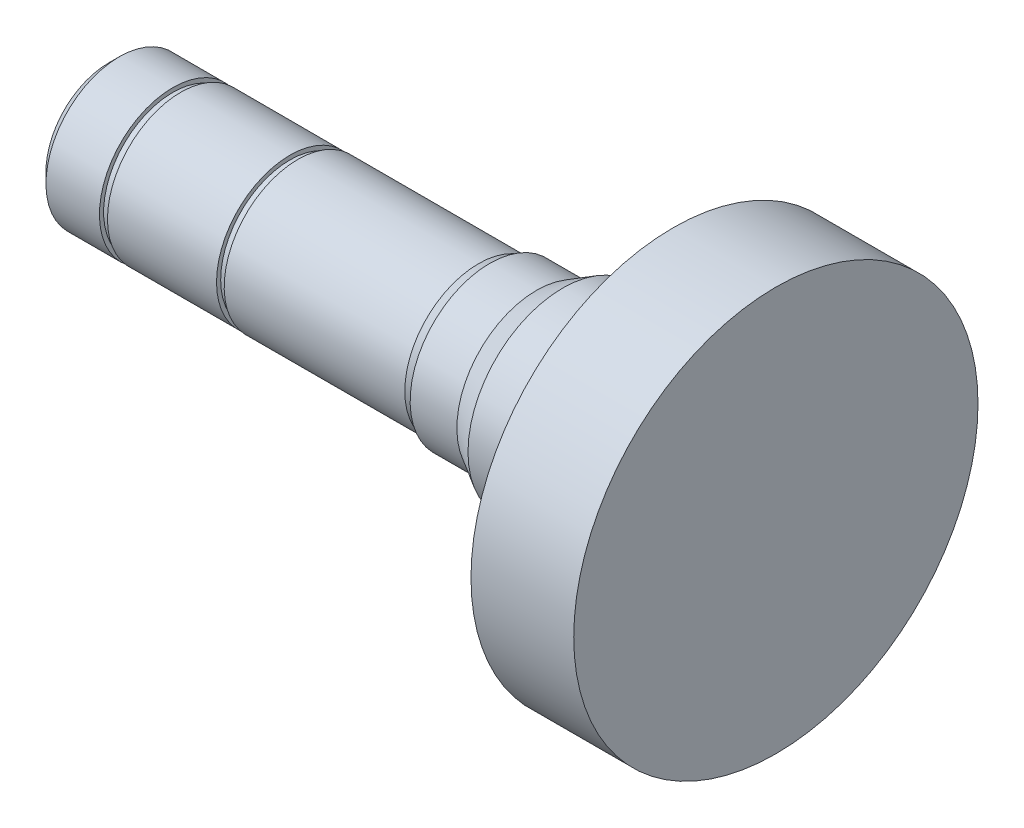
ISO-10303-21;
HEADER;
FILE_DESCRIPTION(('STEP AP214'),'2;1');
FILE_NAME('part.step','',(''),(''),'','','');
FILE_SCHEMA(('AUTOMOTIVE_DESIGN { 1 0 10303 214 1 1 1 1 }'));
ENDSEC;
DATA;
#1=APPLICATION_CONTEXT('core data for automotive mechanical design processes');
#2=APPLICATION_PROTOCOL_DEFINITION('international standard','automotive_design',2000,#1);
#3=PRODUCT_CONTEXT('',#1,'mechanical');
#4=PRODUCT('Part','Part','',(#3));
#5=PRODUCT_RELATED_PRODUCT_CATEGORY('part','',(#4));
#6=PRODUCT_DEFINITION_FORMATION('','',#4);
#7=PRODUCT_DEFINITION_CONTEXT('part definition',#1,'design');
#8=PRODUCT_DEFINITION('design','',#6,#7);
#9=PRODUCT_DEFINITION_SHAPE('','',#8);
#10=(LENGTH_UNIT() NAMED_UNIT(*) SI_UNIT(.MILLI.,.METRE.));
#11=(NAMED_UNIT(*) PLANE_ANGLE_UNIT() SI_UNIT($,.RADIAN.));
#12=(NAMED_UNIT(*) SI_UNIT($,.STERADIAN.) SOLID_ANGLE_UNIT());
#13=UNCERTAINTY_MEASURE_WITH_UNIT(LENGTH_MEASURE(1.E-05),#10,'distance_accuracy_value','');
#14=(GEOMETRIC_REPRESENTATION_CONTEXT(3) GLOBAL_UNCERTAINTY_ASSIGNED_CONTEXT((#13)) GLOBAL_UNIT_ASSIGNED_CONTEXT((#10,
#11,#12)) REPRESENTATION_CONTEXT('',''));
#15=CARTESIAN_POINT('',(0.,0.,0.));
#16=DIRECTION('',(0.,0.,1.));
#17=DIRECTION('',(1.,0.,0.));
#18=AXIS2_PLACEMENT_3D('',#15,#16,#17);
#19=CARTESIAN_POINT('',(0.,0.,0.));
#20=DIRECTION('',(1.,0.,0.));
#21=DIRECTION('',(0.,1.,0.));
#22=AXIS2_PLACEMENT_3D('',#19,#20,#21);
#23=PLANE('',#22);
#24=CARTESIAN_POINT('',(0.,0.,0.));
#25=DIRECTION('',(1.,0.,0.));
#26=DIRECTION('',(0.,1.,0.));
#27=AXIS2_PLACEMENT_3D('',#24,#25,#26);
#28=CIRCLE('',#27,14.925);
#29=CARTESIAN_POINT('',(0.,14.925,0.));
#30=VERTEX_POINT('',#29);
#31=EDGE_CURVE('E156',#30,#30,#28,.T.);
#32=ORIENTED_EDGE('',*,*,#31,.F.);
#33=EDGE_LOOP('',(#32));
#34=FACE_BOUND('',#33,.T.);
#35=CARTESIAN_POINT('',(0.,0.,0.));
#36=DIRECTION('',(1.,0.,0.));
#37=DIRECTION('',(0.,1.,0.));
#38=AXIS2_PLACEMENT_3D('',#35,#36,#37);
#39=CIRCLE('',#38,7.055);
#40=CARTESIAN_POINT('',(0.,7.05499999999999,0.));
#41=VERTEX_POINT('',#40);
#42=EDGE_CURVE('E77',#41,#41,#39,.T.);
#43=ORIENTED_EDGE('',*,*,#42,.T.);
#44=EDGE_LOOP('',(#43));
#45=FACE_BOUND('',#44,.T.);
#46=ADVANCED_FACE('F56',(#34,#45),#23,.F.);
#47=CARTESIAN_POINT('',(78.2,0.,0.));
#48=DIRECTION('',(1.,0.,0.));
#49=DIRECTION('',(0.,0.877582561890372,0.479425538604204));
#50=AXIS2_PLACEMENT_3D('',#47,#48,#49);
#51=CYLINDRICAL_SURFACE('',#50,17.425);
#52=CARTESIAN_POINT('',(2.5,0.,0.));
#53=DIRECTION('',(1.,0.,0.));
#54=DIRECTION('',(0.,1.,0.));
#55=AXIS2_PLACEMENT_3D('',#52,#53,#54);
#56=CIRCLE('',#55,17.425);
#57=CARTESIAN_POINT('',(2.5,17.425,0.));
#58=VERTEX_POINT('',#57);
#59=EDGE_CURVE('E117',#58,#58,#56,.T.);
#60=ORIENTED_EDGE('',*,*,#59,.T.);
#61=EDGE_LOOP('',(#60));
#62=FACE_BOUND('',#61,.T.);
#63=CARTESIAN_POINT('',(15.2,-1.0001519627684E-11,1.0001519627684E-11));
#64=DIRECTION('',(1.,0.,0.));
#65=DIRECTION('',(0.,0.,-1.));
#66=AXIS2_PLACEMENT_3D('',#63,#64,#65);
#67=CIRCLE('',#66,17.4249999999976);
#68=CARTESIAN_POINT('',(15.2,-1.0001519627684E-11,-17.4249999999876));
#69=VERTEX_POINT('',#68);
#70=EDGE_CURVE('E102',#69,#69,#67,.T.);
#71=ORIENTED_EDGE('',*,*,#70,.F.);
#72=EDGE_LOOP('',(#71));
#73=FACE_BOUND('',#72,.T.);
#74=ADVANCED_FACE('F780',(#62,#73),#51,.T.);
#75=CARTESIAN_POINT('',(101.551626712,0.,0.));
#76=DIRECTION('',(1.,0.,0.));
#77=DIRECTION('',(0.,0.877582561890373,0.479425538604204));
#78=AXIS2_PLACEMENT_3D('',#75,#76,#77);
#79=CONICAL_SURFACE('',#78,18.9,0.523598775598);
#80=CARTESIAN_POINT('',(101.551626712,0.,0.));
#81=DIRECTION('',(1.,0.,0.));
#82=DIRECTION('',(0.,1.,0.));
#83=AXIS2_PLACEMENT_3D('',#80,#81,#82);
#84=CIRCLE('',#83,18.9);
#85=CARTESIAN_POINT('',(101.551626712,18.9,0.));
#86=VERTEX_POINT('',#85);
#87=EDGE_CURVE('E532',#86,#86,#84,.T.);
#88=ORIENTED_EDGE('',*,*,#87,.T.);
#89=EDGE_LOOP('',(#88));
#90=FACE_BOUND('',#89,.T.);
#91=CARTESIAN_POINT('',(107.8,0.,0.));
#92=DIRECTION('',(1.,0.,0.));
#93=DIRECTION('',(0.,0.,-1.));
#94=AXIS2_PLACEMENT_3D('',#91,#92,#93);
#95=CIRCLE('',#94,22.5075);
#96=CARTESIAN_POINT('',(107.8,0.,-22.5075));
#97=VERTEX_POINT('',#96);
#98=EDGE_CURVE('E95',#97,#97,#95,.T.);
#99=ORIENTED_EDGE('',*,*,#98,.F.);
#100=EDGE_LOOP('',(#99));
#101=FACE_BOUND('',#100,.T.);
#102=ADVANCED_FACE('F4323',(#90,#101),#79,.T.);
#103=CARTESIAN_POINT('',(78.2,0.,0.));
#104=DIRECTION('',(1.,0.,0.));
#105=DIRECTION('',(0.,0.877582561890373,0.479425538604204));
#106=AXIS2_PLACEMENT_3D('',#103,#104,#105);
#107=CYLINDRICAL_SURFACE('',#106,18.9);
#108=CARTESIAN_POINT('',(90.45,0.,0.));
#109=DIRECTION('',(1.,0.,0.));
#110=DIRECTION('',(0.,1.,0.));
#111=AXIS2_PLACEMENT_3D('',#108,#109,#110);
#112=CIRCLE('',#111,18.9);
#113=CARTESIAN_POINT('',(90.45,18.9,0.));
#114=VERTEX_POINT('',#113);
#115=EDGE_CURVE('E123',#114,#114,#112,.T.);
#116=ORIENTED_EDGE('',*,*,#115,.T.);
#117=EDGE_LOOP('',(#116));
#118=FACE_BOUND('',#117,.T.);
#119=ORIENTED_EDGE('',*,*,#87,.F.);
#120=EDGE_LOOP('',(#119));
#121=FACE_BOUND('',#120,.T.);
#122=ADVANCED_FACE('F4332',(#118,#121),#107,.T.);
#123=CARTESIAN_POINT('',(90.45,17.4575,0.));
#124=DIRECTION('',(1.,0.,0.));
#125=DIRECTION('',(0.,1.,0.));
#126=AXIS2_PLACEMENT_3D('',#123,#124,#125);
#127=PLANE('',#126);
#128=ORIENTED_EDGE('',*,*,#115,.F.);
#129=EDGE_LOOP('',(#128));
#130=FACE_BOUND('',#129,.T.);
#131=CARTESIAN_POINT('',(90.45,0.,0.));
#132=DIRECTION('',(1.,0.,0.));
#133=DIRECTION('',(0.,1.,0.));
#134=AXIS2_PLACEMENT_3D('',#131,#132,#133);
#135=CIRCLE('',#134,17.4575);
#136=CARTESIAN_POINT('',(90.45,17.4575,0.));
#137=VERTEX_POINT('',#136);
#138=EDGE_CURVE('E118',#137,#137,#135,.T.);
#139=ORIENTED_EDGE('',*,*,#138,.T.);
#140=EDGE_LOOP('',(#139));
#141=FACE_BOUND('',#140,.T.);
#142=ADVANCED_FACE('F4330',(#130,#141),#127,.F.);
#143=CARTESIAN_POINT('',(89.65,0.,0.));
#144=DIRECTION('',(1.,0.,0.));
#145=DIRECTION('',(0.,0.877582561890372,0.479425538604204));
#146=AXIS2_PLACEMENT_3D('',#143,#144,#145);
#147=TOROIDAL_SURFACE('',#146,17.4575,0.8);
#148=CARTESIAN_POINT('',(89.2868076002,0.,0.));
#149=DIRECTION('',(1.,0.,0.));
#150=DIRECTION('',(0.,1.,0.));
#151=AXIS2_PLACEMENT_3D('',#148,#149,#150);
#152=CIRCLE('',#151,16.7446947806);
#153=CARTESIAN_POINT('',(89.2868076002,16.7446947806,0.));
#154=VERTEX_POINT('',#153);
#155=EDGE_CURVE('E124',#154,#154,#152,.T.);
#156=ORIENTED_EDGE('',*,*,#155,.T.);
#157=EDGE_LOOP('',(#156));
#158=FACE_BOUND('',#157,.T.);
#159=ORIENTED_EDGE('',*,*,#138,.F.);
#160=EDGE_LOOP('',(#159));
#161=FACE_BOUND('',#160,.T.);
#162=ADVANCED_FACE('F782',(#158,#161),#147,.F.);
#163=CARTESIAN_POINT('',(89.2868076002,0.,0.));
#164=DIRECTION('',(-1.,0.,0.));
#165=DIRECTION('',(0.,0.877582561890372,0.479425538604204));
#166=AXIS2_PLACEMENT_3D('',#163,#164,#165);
#167=CONICAL_SURFACE('',#166,16.7446947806,0.471238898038);
#168=CARTESIAN_POINT('',(87.7897180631,0.,0.));
#169=DIRECTION('',(1.,0.,0.));
#170=DIRECTION('',(0.,-1.,0.));
#171=AXIS2_PLACEMENT_3D('',#168,#169,#170);
#172=CIRCLE('',#171,17.5075);
#173=CARTESIAN_POINT('',(87.7897180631,-17.5075,0.));
#174=VERTEX_POINT('',#173);
#175=EDGE_CURVE('E125',#174,#174,#172,.T.);
#176=ORIENTED_EDGE('',*,*,#175,.T.);
#177=EDGE_LOOP('',(#176));
#178=FACE_BOUND('',#177,.T.);
#179=ORIENTED_EDGE('',*,*,#155,.F.);
#180=EDGE_LOOP('',(#179));
#181=FACE_BOUND('',#180,.T.);
#182=ADVANCED_FACE('F199',(#178,#181),#167,.T.);
#183=CARTESIAN_POINT('',(78.2,0.,0.));
#184=DIRECTION('',(1.,0.,0.));
#185=DIRECTION('',(0.,0.877582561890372,0.479425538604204));
#186=AXIS2_PLACEMENT_3D('',#183,#184,#185);
#187=CYLINDRICAL_SURFACE('',#186,17.5075);
#188=ORIENTED_EDGE('',*,*,#175,.F.);
#189=EDGE_LOOP('',(#188));
#190=FACE_BOUND('',#189,.T.);
#191=CARTESIAN_POINT('',(44.9,0.,0.));
#192=DIRECTION('',(1.,0.,0.));
#193=DIRECTION('',(0.,1.,0.));
#194=AXIS2_PLACEMENT_3D('',#191,#192,#193);
#195=CIRCLE('',#194,17.5075);
#196=CARTESIAN_POINT('',(44.9,17.5075,0.));
#197=VERTEX_POINT('',#196);
#198=EDGE_CURVE('E531',#197,#197,#195,.T.);
#199=ORIENTED_EDGE('',*,*,#198,.T.);
#200=EDGE_LOOP('',(#199));
#201=FACE_BOUND('',#200,.T.);
#202=ADVANCED_FACE('F188',(#190,#201),#187,.T.);
#203=CARTESIAN_POINT('',(44.9,16.44,0.));
#204=DIRECTION('',(1.,0.,0.));
#205=DIRECTION('',(0.,1.,0.));
#206=AXIS2_PLACEMENT_3D('',#203,#204,#205);
#207=PLANE('',#206);
#208=CARTESIAN_POINT('',(44.9,0.,0.));
#209=DIRECTION('',(1.,0.,0.));
#210=DIRECTION('',(0.,1.,0.));
#211=AXIS2_PLACEMENT_3D('',#208,#209,#210);
#212=CIRCLE('',#211,16.44);
#213=CARTESIAN_POINT('',(44.9,16.44,0.));
#214=VERTEX_POINT('',#213);
#215=EDGE_CURVE('E526',#214,#214,#212,.T.);
#216=ORIENTED_EDGE('',*,*,#215,.T.);
#217=EDGE_LOOP('',(#216));
#218=FACE_BOUND('',#217,.T.);
#219=ORIENTED_EDGE('',*,*,#198,.F.);
#220=EDGE_LOOP('',(#219));
#221=FACE_BOUND('',#220,.T.);
#222=ADVANCED_FACE('F198',(#218,#221),#207,.F.);
#223=CARTESIAN_POINT('',(78.2,0.,0.));
#224=DIRECTION('',(1.,0.,0.));
#225=DIRECTION('',(0.,0.877582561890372,0.479425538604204));
#226=AXIS2_PLACEMENT_3D('',#223,#224,#225);
#227=CYLINDRICAL_SURFACE('',#226,16.44);
#228=CARTESIAN_POINT('',(43.,1.00015962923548E-11,1.00015962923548E-11));
#229=DIRECTION('',(-1.,0.,0.));
#230=DIRECTION('',(0.,0.,1.));
#231=AXIS2_PLACEMENT_3D('',#228,#229,#230);
#232=CIRCLE('',#231,16.4399999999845);
#233=CARTESIAN_POINT('',(43.,1.00015962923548E-11,16.4399999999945));
#234=VERTEX_POINT('',#233);
#235=EDGE_CURVE('E114',#234,#234,#232,.T.);
#236=ORIENTED_EDGE('',*,*,#235,.F.);
#237=EDGE_LOOP('',(#236));
#238=FACE_BOUND('',#237,.T.);
#239=ORIENTED_EDGE('',*,*,#215,.F.);
#240=EDGE_LOOP('',(#239));
#241=FACE_BOUND('',#240,.T.);
#242=ADVANCED_FACE('F201',(#238,#241),#227,.T.);
#243=CARTESIAN_POINT('',(0.,0.,0.));
#244=DIRECTION('',(1.,0.,0.));
#245=DIRECTION('',(0.,0.877582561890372,0.479425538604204));
#246=AXIS2_PLACEMENT_3D('',#243,#244,#245);
#247=CONICAL_SURFACE('',#246,14.925,0.785398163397);
#248=ORIENTED_EDGE('',*,*,#31,.T.);
#249=EDGE_LOOP('',(#248));
#250=FACE_BOUND('',#249,.T.);
#251=ORIENTED_EDGE('',*,*,#59,.F.);
#252=EDGE_LOOP('',(#251));
#253=FACE_BOUND('',#252,.T.);
#254=ADVANCED_FACE('F768',(#250,#253),#247,.T.);
#255=CARTESIAN_POINT('',(43.,0.,0.));
#256=DIRECTION('',(1.,0.,0.));
#257=DIRECTION('',(0.,0.,-1.));
#258=AXIS2_PLACEMENT_3D('',#255,#256,#257);
#259=CIRCLE('',#258,17.425);
#260=CARTESIAN_POINT('',(43.,0.,-17.425));
#261=VERTEX_POINT('',#260);
#262=EDGE_CURVE('E109',#261,#261,#259,.T.);
#263=ORIENTED_EDGE('',*,*,#262,.F.);
#264=EDGE_LOOP('',(#263));
#265=FACE_BOUND('',#264,.T.);
#266=CARTESIAN_POINT('',(17.1,0.,0.));
#267=DIRECTION('',(-1.,0.,0.));
#268=DIRECTION('',(0.,0.,1.));
#269=AXIS2_PLACEMENT_3D('',#266,#267,#268);
#270=CIRCLE('',#269,17.425);
#271=CARTESIAN_POINT('',(17.1,0.,17.425));
#272=VERTEX_POINT('',#271);
#273=EDGE_CURVE('E99',#272,#272,#270,.T.);
#274=ORIENTED_EDGE('',*,*,#273,.F.);
#275=EDGE_LOOP('',(#274));
#276=FACE_BOUND('',#275,.T.);
#277=ADVANCED_FACE('F778',(#265,#276),#51,.T.);
#278=CARTESIAN_POINT('',(43.,1.00015962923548E-11,1.00015962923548E-11));
#279=DIRECTION('',(1.,0.,0.));
#280=DIRECTION('',(0.,0.,-1.));
#281=AXIS2_PLACEMENT_3D('',#278,#279,#280);
#282=PLANE('',#281);
#283=ORIENTED_EDGE('',*,*,#262,.T.);
#284=EDGE_LOOP('',(#283));
#285=FACE_BOUND('',#284,.T.);
#286=ORIENTED_EDGE('',*,*,#235,.T.);
#287=EDGE_LOOP('',(#286));
#288=FACE_BOUND('',#287,.T.);
#289=ADVANCED_FACE('F4350',(#285,#288),#282,.T.);
#290=CARTESIAN_POINT('',(17.1,0.,0.));
#291=DIRECTION('',(-1.,0.,0.));
#292=DIRECTION('',(0.,0.,1.));
#293=AXIS2_PLACEMENT_3D('',#290,#291,#292);
#294=CYLINDRICAL_SURFACE('',#293,16.4399999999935);
#295=CARTESIAN_POINT('',(15.2,0.,0.));
#296=DIRECTION('',(1.,0.,0.));
#297=DIRECTION('',(0.,0.,-1.));
#298=AXIS2_PLACEMENT_3D('',#295,#296,#297);
#299=CIRCLE('',#298,16.4399999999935);
#300=CARTESIAN_POINT('',(15.2,0.,-16.4399999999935));
#301=VERTEX_POINT('',#300);
#302=EDGE_CURVE('E105',#301,#301,#299,.T.);
#303=ORIENTED_EDGE('',*,*,#302,.T.);
#304=EDGE_LOOP('',(#303));
#305=FACE_BOUND('',#304,.T.);
#306=CARTESIAN_POINT('',(17.1,0.,0.));
#307=DIRECTION('',(1.,0.,0.));
#308=DIRECTION('',(0.,0.,-1.));
#309=AXIS2_PLACEMENT_3D('',#306,#307,#308);
#310=CIRCLE('',#309,16.4399999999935);
#311=CARTESIAN_POINT('',(17.1,0.,-16.4399999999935));
#312=VERTEX_POINT('',#311);
#313=EDGE_CURVE('E106',#312,#312,#310,.T.);
#314=ORIENTED_EDGE('',*,*,#313,.F.);
#315=EDGE_LOOP('',(#314));
#316=FACE_BOUND('',#315,.T.);
#317=ADVANCED_FACE('F4353',(#305,#316),#294,.T.);
#318=CARTESIAN_POINT('',(17.1,0.,0.));
#319=DIRECTION('',(1.,0.,0.));
#320=DIRECTION('',(0.,0.,-1.));
#321=AXIS2_PLACEMENT_3D('',#318,#319,#320);
#322=PLANE('',#321);
#323=ORIENTED_EDGE('',*,*,#313,.T.);
#324=EDGE_LOOP('',(#323));
#325=FACE_BOUND('',#324,.T.);
#326=ORIENTED_EDGE('',*,*,#273,.T.);
#327=EDGE_LOOP('',(#326));
#328=FACE_BOUND('',#327,.T.);
#329=ADVANCED_FACE('F4357',(#325,#328),#322,.F.);
#330=CARTESIAN_POINT('',(15.2,0.,0.));
#331=DIRECTION('',(1.,0.,0.));
#332=DIRECTION('',(0.,0.,-1.));
#333=AXIS2_PLACEMENT_3D('',#330,#331,#332);
#334=PLANE('',#333);
#335=ORIENTED_EDGE('',*,*,#302,.F.);
#336=EDGE_LOOP('',(#335));
#337=FACE_BOUND('',#336,.T.);
#338=ORIENTED_EDGE('',*,*,#70,.T.);
#339=EDGE_LOOP('',(#338));
#340=FACE_BOUND('',#339,.T.);
#341=ADVANCED_FACE('F4359',(#337,#340),#334,.T.);
#342=CARTESIAN_POINT('',(133.8,0.,0.));
#343=DIRECTION('',(-1.,0.,0.));
#344=DIRECTION('',(0.,0.,1.));
#345=AXIS2_PLACEMENT_3D('',#342,#343,#344);
#346=CYLINDRICAL_SURFACE('',#345,22.5075);
#347=CARTESIAN_POINT('',(132.6,0.,0.));
#348=DIRECTION('',(1.,0.,0.));
#349=DIRECTION('',(0.,0.,-1.));
#350=AXIS2_PLACEMENT_3D('',#347,#348,#349);
#351=CIRCLE('',#350,22.5075);
#352=CARTESIAN_POINT('',(132.6,0.,-22.5075));
#353=VERTEX_POINT('',#352);
#354=EDGE_CURVE('E13',#353,#353,#351,.F.);
#355=ORIENTED_EDGE('',*,*,#354,.T.);
#356=EDGE_LOOP('',(#355));
#357=FACE_BOUND('',#356,.T.);
#358=ORIENTED_EDGE('',*,*,#98,.T.);
#359=EDGE_LOOP('',(#358));
#360=FACE_BOUND('',#359,.T.);
#361=ADVANCED_FACE('F4362',(#357,#360),#346,.T.);
#362=CARTESIAN_POINT('',(134.,0.,0.));
#363=DIRECTION('',(-1.,0.,0.));
#364=DIRECTION('',(0.,0.,1.));
#365=AXIS2_PLACEMENT_3D('',#362,#363,#364);
#366=CYLINDRICAL_SURFACE('',#365,32.);
#367=CARTESIAN_POINT('',(134.,0.,0.));
#368=DIRECTION('',(-1.,0.,0.));
#369=DIRECTION('',(0.,0.,-1.));
#370=AXIS2_PLACEMENT_3D('',#367,#368,#369);
#371=CIRCLE('',#370,32.);
#372=CARTESIAN_POINT('',(134.,0.,-32.));
#373=VERTEX_POINT('',#372);
#374=EDGE_CURVE('E89',#373,#373,#371,.T.);
#375=ORIENTED_EDGE('',*,*,#374,.T.);
#376=EDGE_LOOP('',(#375));
#377=FACE_BOUND('',#376,.T.);
#378=CARTESIAN_POINT('',(133.8,0.,0.));
#379=DIRECTION('',(-1.,0.,0.));
#380=DIRECTION('',(0.,0.,-1.));
#381=AXIS2_PLACEMENT_3D('',#378,#379,#380);
#382=CIRCLE('',#381,32.);
#383=CARTESIAN_POINT('',(133.8,0.,-32.));
#384=VERTEX_POINT('',#383);
#385=EDGE_CURVE('E92',#384,#384,#382,.T.);
#386=ORIENTED_EDGE('',*,*,#385,.F.);
#387=EDGE_LOOP('',(#386));
#388=FACE_BOUND('',#387,.T.);
#389=ADVANCED_FACE('F4369',(#377,#388),#366,.T.);
#390=CARTESIAN_POINT('',(133.8,0.,0.));
#391=DIRECTION('',(1.,0.,0.));
#392=DIRECTION('',(0.,0.,-1.));
#393=AXIS2_PLACEMENT_3D('',#390,#391,#392);
#394=PLANE('',#393);
#395=CARTESIAN_POINT('',(133.8,0.,0.));
#396=DIRECTION('',(1.,0.,0.));
#397=DIRECTION('',(0.,0.,-1.));
#398=AXIS2_PLACEMENT_3D('',#395,#396,#397);
#399=CIRCLE('',#398,23.7075);
#400=CARTESIAN_POINT('',(133.8,0.,-23.7075));
#401=VERTEX_POINT('',#400);
#402=EDGE_CURVE('E63',#401,#401,#399,.T.);
#403=ORIENTED_EDGE('',*,*,#402,.T.);
#404=EDGE_LOOP('',(#403));
#405=FACE_BOUND('',#404,.T.);
#406=ORIENTED_EDGE('',*,*,#385,.T.);
#407=EDGE_LOOP('',(#406));
#408=FACE_BOUND('',#407,.T.);
#409=ADVANCED_FACE('F4301',(#405,#408),#394,.F.);
#410=CARTESIAN_POINT('',(156.4,0.,0.));
#411=DIRECTION('',(-1.,0.,0.));
#412=DIRECTION('',(0.,0.,1.));
#413=AXIS2_PLACEMENT_3D('',#410,#411,#412);
#414=CYLINDRICAL_SURFACE('',#413,48.);
#415=CARTESIAN_POINT('',(134.,0.,0.));
#416=DIRECTION('',(-1.,0.,0.));
#417=DIRECTION('',(0.,0.,-1.));
#418=AXIS2_PLACEMENT_3D('',#415,#416,#417);
#419=CIRCLE('',#418,48.);
#420=CARTESIAN_POINT('',(134.,0.,-48.));
#421=VERTEX_POINT('',#420);
#422=EDGE_CURVE('E80',#421,#421,#419,.T.);
#423=ORIENTED_EDGE('',*,*,#422,.F.);
#424=EDGE_LOOP('',(#423));
#425=FACE_BOUND('',#424,.T.);
#426=CARTESIAN_POINT('',(158.4,0.,0.));
#427=DIRECTION('',(-1.,0.,0.));
#428=DIRECTION('',(0.,0.,1.));
#429=AXIS2_PLACEMENT_3D('',#426,#427,#428);
#430=CIRCLE('',#429,48.);
#431=CARTESIAN_POINT('',(158.4,0.,48.));
#432=VERTEX_POINT('',#431);
#433=EDGE_CURVE('E76',#432,#432,#430,.T.);
#434=ORIENTED_EDGE('',*,*,#433,.T.);
#435=EDGE_LOOP('',(#434));
#436=FACE_BOUND('',#435,.T.);
#437=ADVANCED_FACE('F4314',(#425,#436),#414,.T.);
#438=CARTESIAN_POINT('',(134.,0.,0.));
#439=DIRECTION('',(1.,0.,0.));
#440=DIRECTION('',(0.,0.,-1.));
#441=AXIS2_PLACEMENT_3D('',#438,#439,#440);
#442=PLANE('',#441);
#443=ORIENTED_EDGE('',*,*,#374,.F.);
#444=EDGE_LOOP('',(#443));
#445=FACE_BOUND('',#444,.T.);
#446=ORIENTED_EDGE('',*,*,#422,.T.);
#447=EDGE_LOOP('',(#446));
#448=FACE_BOUND('',#447,.T.);
#449=ADVANCED_FACE('F4306',(#445,#448),#442,.F.);
#450=CARTESIAN_POINT('',(132.6,0.,0.));
#451=DIRECTION('',(1.,0.,0.));
#452=DIRECTION('',(0.,0.,-1.));
#453=AXIS2_PLACEMENT_3D('',#450,#451,#452);
#454=TOROIDAL_SURFACE('',#453,23.7075,1.2);
#455=ORIENTED_EDGE('',*,*,#354,.F.);
#456=EDGE_LOOP('',(#455));
#457=FACE_BOUND('',#456,.T.);
#458=ORIENTED_EDGE('',*,*,#402,.F.);
#459=EDGE_LOOP('',(#458));
#460=FACE_BOUND('',#459,.T.);
#461=ADVANCED_FACE('F58',(#457,#460),#454,.F.);
#462=CARTESIAN_POINT('',(158.4,48.,0.));
#463=DIRECTION('',(-1.,0.,0.));
#464=DIRECTION('',(0.,0.,1.));
#465=AXIS2_PLACEMENT_3D('',#462,#463,#464);
#466=PLANE('',#465);
#467=ORIENTED_EDGE('',*,*,#433,.F.);
#468=EDGE_LOOP('',(#467));
#469=FACE_BOUND('',#468,.T.);
#470=ADVANCED_FACE('F4305',(#469),#466,.F.);
#471=CARTESIAN_POINT('',(0.,0.,0.));
#472=DIRECTION('',(-1.,0.,0.));
#473=DIRECTION('',(0.,-1.,0.));
#474=AXIS2_PLACEMENT_3D('',#471,#472,#473);
#475=CONICAL_SURFACE('',#474,7.055,0.523085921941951);
#476=CARTESIAN_POINT('',(3.,0.,0.));
#477=DIRECTION('',(1.,0.,0.));
#478=DIRECTION('',(0.,1.,0.));
#479=AXIS2_PLACEMENT_3D('',#476,#477,#478);
#480=CIRCLE('',#479,5.32499999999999);
#481=CARTESIAN_POINT('',(3.,5.32499999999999,0.));
#482=VERTEX_POINT('',#481);
#483=EDGE_CURVE('E83',#482,#482,#480,.T.);
#484=ORIENTED_EDGE('',*,*,#483,.T.);
#485=EDGE_LOOP('',(#484));
#486=FACE_BOUND('',#485,.T.);
#487=ORIENTED_EDGE('',*,*,#42,.F.);
#488=EDGE_LOOP('',(#487));
#489=FACE_BOUND('',#488,.T.);
#490=ADVANCED_FACE('F70',(#486,#489),#475,.F.);
#491=CARTESIAN_POINT('',(28.,0.,0.));
#492=DIRECTION('',(-1.,0.,0.));
#493=DIRECTION('',(0.,0.,1.));
#494=AXIS2_PLACEMENT_3D('',#491,#492,#493);
#495=CONICAL_SURFACE('',#494,5.32499999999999,1.02974425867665);
#496=CARTESIAN_POINT('',(31.1995827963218,0.,0.));
#497=VERTEX_POINT('',#496);
#498=VERTEX_LOOP('',#497);
#499=FACE_BOUND('',#498,.T.);
#500=CARTESIAN_POINT('',(28.,0.,0.));
#501=DIRECTION('',(-1.,0.,0.));
#502=DIRECTION('',(0.,0.,1.));
#503=AXIS2_PLACEMENT_3D('',#500,#501,#502);
#504=CIRCLE('',#503,5.32499999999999);
#505=CARTESIAN_POINT('',(28.,0.,5.32499999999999));
#506=VERTEX_POINT('',#505);
#507=EDGE_CURVE('E74',#506,#506,#504,.T.);
#508=ORIENTED_EDGE('',*,*,#507,.T.);
#509=EDGE_LOOP('',(#508));
#510=FACE_BOUND('',#509,.T.);
#511=ADVANCED_FACE('F66',(#499,#510),#495,.F.);
#512=CARTESIAN_POINT('',(0.,0.,0.));
#513=DIRECTION('',(-1.,0.,0.));
#514=DIRECTION('',(0.,0.,1.));
#515=AXIS2_PLACEMENT_3D('',#512,#513,#514);
#516=CYLINDRICAL_SURFACE('',#515,5.32499999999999);
#517=ORIENTED_EDGE('',*,*,#507,.F.);
#518=EDGE_LOOP('',(#517));
#519=FACE_BOUND('',#518,.T.);
#520=ORIENTED_EDGE('',*,*,#483,.F.);
#521=EDGE_LOOP('',(#520));
#522=FACE_BOUND('',#521,.T.);
#523=ADVANCED_FACE('F69',(#519,#522),#516,.F.);
#524=CLOSED_SHELL('',(#46,#74,#102,#122,#142,#162,#182,#202,#222,#242,#254,#277,#289,#317,#329,
#341,#361,#389,#409,#437,#449,#461,#470,#490,#511,#523));
#525=MANIFOLD_SOLID_BREP('B2',#524);
#526=ADVANCED_BREP_SHAPE_REPRESENTATION('',(#18,#525),#14);
#527=SHAPE_DEFINITION_REPRESENTATION(#9,#526);
ENDSEC;
END-ISO-10303-21;
